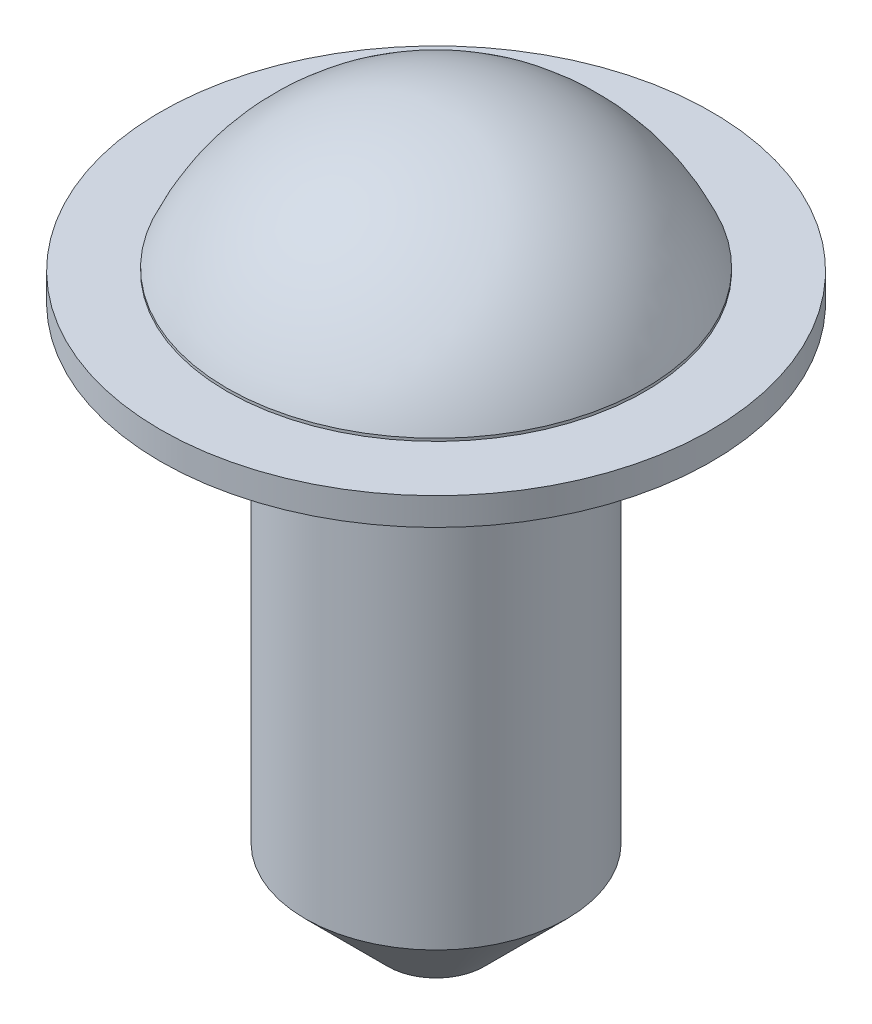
from build123d import *

# Parameters (mm, degrees)
ESQUISSE1_R        = 0.95
BOSS_EXTRU_1_DEPTH = 4
ESQUISSE2_R        = 2
BOSS_EXTRU_2_DEPTH = 0.2
ESQUISSE3_R        = 1.517629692
BOSS_EXTRU_3_DEPTH = 0.02
D_ME1_FACE_RADIUS  = 1.517629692
D_ME1_HEIGHT       = 1
CHANFREIN1_SIZE    = 0.6


with BuildPart() as part:
    # Esquisse1 → Boss.-Extru.1 (new body)
    with BuildSketch(Plane(origin=(0, 0, 0), x_dir=(1, 0, 0), z_dir=(0, 1, 0))):
        with Locations(Location((0, 0, 0), (0, 0, 270))):
            Circle(ESQUISSE1_R)
    extrude(amount=BOSS_EXTRU_1_DEPTH)

    # Esquisse2 → Boss.-Extru.2 (add)
    with BuildSketch(Plane(origin=(0, 4, 0), x_dir=(1, 0, 0), z_dir=(0, 1, 0))):
        with Locations(Location((0, 0, 0), (0, 0, 270))):
            Circle(ESQUISSE2_R)
    extrude(amount=BOSS_EXTRU_2_DEPTH)

    # Esquisse3 → Boss.-Extru.3 (add)
    with BuildSketch(Plane(origin=(0, 4.2, 0), x_dir=(1, 0, 0), z_dir=(0, 1, 0))):
        with Locations(Location((0, 0, 0), (0, 0, 90))):
            Circle(ESQUISSE3_R)
    extrude(amount=BOSS_EXTRU_3_DEPTH)

    # D_me1: a dome of height H over a round flat face of radius A is a cap of a sphere of radius (A * A + H * H) / (2 * H)
    d_me1_r = (D_ME1_FACE_RADIUS * D_ME1_FACE_RADIUS + D_ME1_HEIGHT * D_ME1_HEIGHT) / (2 * D_ME1_HEIGHT)
    d_me1_base = Plane((0, 4.22, 0), z_dir=(0, 1, 0))
    with Locations(d_me1_base.offset(D_ME1_HEIGHT - d_me1_r)):
        d_me1_ball = Sphere(d_me1_r, mode=Mode.PRIVATE)
    add(split(d_me1_ball, bisect_by=d_me1_base, keep=Keep.TOP, mode=Mode.PRIVATE))

    # Chanfrein1
    chanfrein1_edges = [part.edges().sort_by_distance(p)[0] for p in [
        (0, 0, -0.95),
    ]]
    chamfer(chanfrein1_edges, length=CHANFREIN1_SIZE)


solid = part.part
